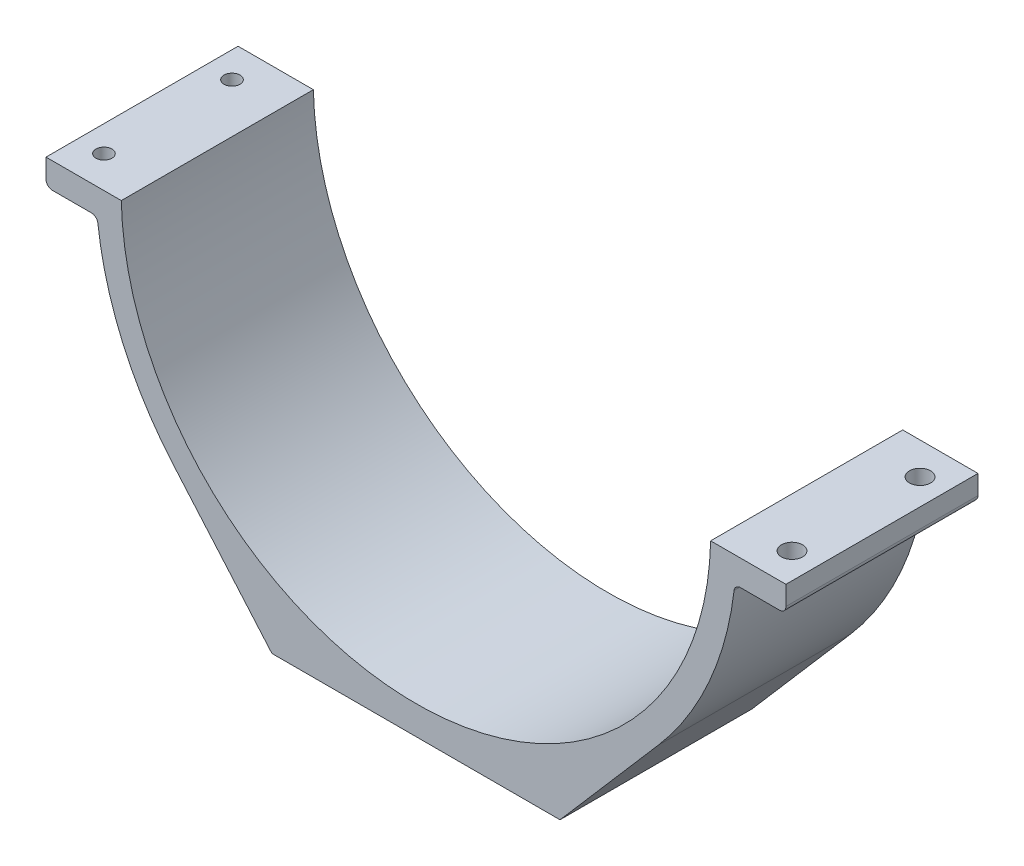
from build123d import *

# Parameters (mm, degrees)
BOSS_EXTRUDE1_DEPTH       = 30
M3X0_5_TAPPED_HOLE1_D     = 2.5
M4X0_7_TAPPED_HOLE1_D     = 3.3
M4X0_7_TAPPED_HOLE1_DEPTH = 7.5
M4X0_7_TAPPED_HOLE1_TIP   = 0.991420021
SKETCH9_R                 = 1.65
CUT_EXTRUDE1_DEPTH        = 80.432955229


with BuildPart() as part:
    # Sketch1 → Boss-Extrude1 (new body)
    with BuildSketch(Plane.XY):
        with BuildLine():
            Line((-57.787060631, -1), (-46.026638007, -1))
            ThreePointArc((-46.026638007, -1), (0, -46.0375), (46.026638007, -1))
            Line((46.026638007, -1), (57.787060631, -1))
            Line((57.787060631, -1), (57.787060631, -4))
            ThreePointArc((57.787060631, -4), (57.494167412, -4.707106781), (56.787060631, -5))
            Line((56.787060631, -5), (50.683591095, -5))
            ThreePointArc((50.683591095, -5), (50.019347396, -5.252483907), (49.690525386, -5.882439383))
            ThreePointArc((49.690525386, -5.882439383), (45.787703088, -20.180130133), (37.867891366, -32.70740298))
            Line((37.867891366, -32.70740298), (22.5, -50.5))
            Line((22.5, -50.5), (-22.5, -50.5))
            Line((-22.5, -50.5), (-37.867891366, -32.70740298))
            ThreePointArc((-37.867891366, -32.70740298), (-45.787703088, -20.180130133), (-49.690525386, -5.882439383))
            ThreePointArc((-49.690525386, -5.882439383), (-50.019347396, -5.252483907), (-50.683591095, -5))
            Line((-50.683591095, -5), (-56.787060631, -5))
            ThreePointArc((-56.787060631, -5), (-57.494167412, -4.707106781), (-57.787060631, -4))
            Line((-57.787060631, -4), (-57.787060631, -1))
        make_face()
    extrude(amount=BOSS_EXTRUDE1_DEPTH)

    # M3x0.5 Tapped Hole1 (through all)
    with Locations(Plane(origin=(-53.735325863, -5, 5), x_dir=(0, 0, -1), z_dir=(0, -1, 0))):
        with Locations((0, 0), (-20, 0)):
            Hole(M3X0_5_TAPPED_HOLE1_D / 2)

    # M4x0.7 Tapped Hole1
    with Locations(Plane(origin=(-20, -50.5, 5), x_dir=(-1, 0, 0), z_dir=(0, -1, 0))):
        with Locations((0, 0), (-40, 0), (0, -20), (-40, -20)):
            Hole(M4X0_7_TAPPED_HOLE1_D / 2, depth=M4X0_7_TAPPED_HOLE1_DEPTH)
            with Locations((0, 0, -(M4X0_7_TAPPED_HOLE1_DEPTH + M4X0_7_TAPPED_HOLE1_TIP / 2))):  # 118° drill point
                Cone(0, M4X0_7_TAPPED_HOLE1_D / 2, M4X0_7_TAPPED_HOLE1_TIP, mode=Mode.SUBTRACT)

    # Sketch9 → Cut-Extrude1 (cut, through all)
    with BuildSketch(Plane.XZ.offset(5)):
        with Locations(Location((53.735325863, 25, 0), (0, 0, 270))):
            Circle(SKETCH9_R)
        with Locations(Location((53.735325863, 5, 0), (0, 0, 270))):
            Circle(SKETCH9_R)
    extrude(amount=-CUT_EXTRUDE1_DEPTH, mode=Mode.SUBTRACT)


solid = part.part
